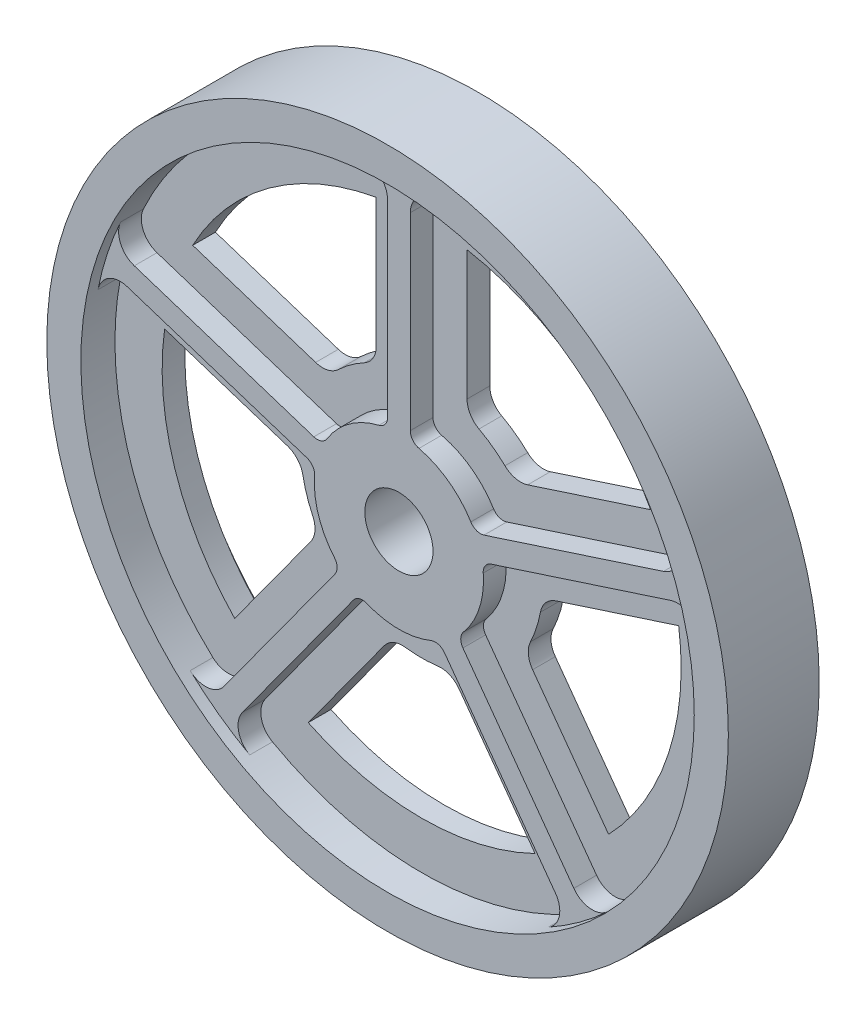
from build123d import *

# Parameters (mm, degrees)
CROQUIS1_R               = 150
CROQUIS1_R_2             = 135
EXTRUIR1_DEPTH           = 20
CROQUIS4_R               = 138.391148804
CROQUIS4_R_2             = 114.224298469
EXTRUIR4_DEPTH           = 5
EXTRUIR5_DEPTH           = 5
EXTRUIR6_DEPTH           = 10
REDONDEO2_R              = 10
REDONDEO3_R              = 10
REDONDEO4_R              = 10
REDONDEO2_OF_SIMETR_A1_R = 10
REDONDEO3_OF_SIMETR_A1_R = 10
REDONDEO4_OF_SIMETR_A1_R = 10
CROQUIS6_R               = 15
EXTRUIR7_DEPTH           = 216


with BuildPart() as part:
    # Croquis1 → Extruir1 (new, symmetric)
    with BuildSketch(Plane.XY):
        Circle(CROQUIS1_R)
        Circle(CROQUIS1_R_2, mode=Mode.SUBTRACT)
    extrude(amount=EXTRUIR1_DEPTH, both=True)

    # Croquis4 → Extruir4 (add, symmetric)
    with BuildSketch(Plane.XY):
        Circle(CROQUIS4_R)
        Circle(CROQUIS4_R_2, mode=Mode.SUBTRACT)
    extrude(amount=EXTRUIR4_DEPTH, both=True)

    # Croquis2 → Extruir5 (add, symmetric)
    with BuildSketch(Plane.XY):
        with BuildLine():
            Line((59.027905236, -1.849915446), (136.416444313, 23.295145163))
            ThreePointArc((136.416444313, 23.295145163), (131.617803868, 42.765216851), (124.055764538, 61.337405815))
            Line((124.055764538, 61.337405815), (46.667225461, 36.192345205))
            ThreePointArc((46.667225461, 36.192345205), (41.358508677, 35.952112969), (36.676313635, 38.465523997))
            ThreePointArc((36.676313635, 38.465523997), (31.239824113, 42.997929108), (25.249283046, 46.767747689))
            ThreePointArc((25.249283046, 46.767747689), (21.412009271, 50.444093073), (20, 55.567218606))
            Line((20, 55.567218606), (20, 136.938344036))
            ThreePointArc((20, 136.938344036), (0, 138.391148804), (-20, 136.938344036))
            Line((-20, 136.938344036), (-20, 55.567218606))
            ThreePointArc((-20, 55.567218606), (-21.412009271, 50.444093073), (-25.249283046, 46.767747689))
            ThreePointArc((-25.249283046, 46.767747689), (-31.239824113, 42.997929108), (-36.676313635, 38.465523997))
            ThreePointArc((-36.676313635, 38.465523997), (-41.358508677, 35.952112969), (-46.667225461, 36.192345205))
            Line((-46.667225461, 36.192345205), (-124.055764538, 61.337405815))
            ThreePointArc((-124.055764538, 61.337405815), (-131.617803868, 42.765216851), (-136.416444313, 23.295145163))
            Line((-136.416444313, 23.295145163), (-59.027905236, -1.849915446))
            ThreePointArc((-59.027905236, -1.849915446), (-54.591858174, -4.775948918), (-52.281228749, -9.561466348))
            ThreePointArc((-52.281228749, -9.561466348), (-50.547097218, -16.423747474), (-47.916491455, -22.994746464))
            ThreePointArc((-47.916491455, -22.994746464), (-46.972973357, -28.224465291), (-48.841931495, -33.199119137))
            Line((-48.841931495, -33.199119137), (-96.670678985, -99.029742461))
            ThreePointArc((-96.670678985, -99.029742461), (-81.344276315, -111.960791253), (-64.30999921, -122.541152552))
            Line((-64.30999921, -122.541152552), (-16.48125172, -56.710529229))
            ThreePointArc((-16.48125172, -56.710529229), (-12.32761459, -53.395791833), (-7.062293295, -52.677058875))
            ThreePointArc((-7.062293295, -52.677058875), (0, -53.14836327), (7.062293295, -52.677058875))
            ThreePointArc((7.062293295, -52.677058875), (12.32761459, -53.395791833), (16.48125172, -56.710529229))
            Line((16.48125172, -56.710529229), (64.30999921, -122.541152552))
            ThreePointArc((64.30999921, -122.541152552), (81.344276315, -111.960791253), (96.670678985, -99.029742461))
            Line((96.670678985, -99.029742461), (48.841931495, -33.199119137))
            ThreePointArc((48.841931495, -33.199119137), (46.972973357, -28.224465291), (47.916491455, -22.994746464))
            ThreePointArc((47.916491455, -22.994746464), (50.547097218, -16.423747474), (52.281228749, -9.561466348))
            ThreePointArc((52.281228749, -9.561466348), (54.591858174, -4.775948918), (59.027905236, -1.849915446))
        make_face()
    extrude(amount=EXTRUIR5_DEPTH, both=True)

    # Croquis5 → Extruir6 (add)
    with BuildSketch(Plane.XY.offset(5)):
        with BuildLine():
            Line((126.75945372, 46.443954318), (37.466944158, 17.431059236))
            ThreePointArc((37.466944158, 17.431059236), (34.199489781, 17.492362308), (31.667832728, 19.558936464))
            ThreePointArc((31.667832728, 19.558936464), (21.877961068, 30.112430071), (8.815755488, 36.161942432))
            ThreePointArc((8.815755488, 36.161942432), (6.068001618, 37.931084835), (5, 41.019674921))
            Line((5, 41.019674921), (5, 134.907375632))
            ThreePointArc((5, 134.907375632), (0, 135), (-5, 134.907375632))
            Line((-5, 134.907375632), (-5, 41.019674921))
            ThreePointArc((-5, 41.019674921), (-6.068001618, 37.931084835), (-8.815755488, 36.161942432))
            ThreePointArc((-8.815755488, 36.161942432), (-21.877961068, 30.112430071), (-31.667832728, 19.558936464))
            ThreePointArc((-31.667832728, 19.558936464), (-34.199489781, 17.492362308), (-37.466944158, 17.431059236))
            Line((-37.466944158, 17.431059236), (-126.75945372, 46.443954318))
            ThreePointArc((-126.75945372, 46.443954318), (-128.3926297, 41.717294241), (-129.849623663, 36.933389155))
            Line((-129.849623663, 36.933389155), (-40.557114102, 7.920494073))
            ThreePointArc((-40.557114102, 7.920494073), (-37.949721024, 5.95033735), (-37.116269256, 2.790373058))
            ThreePointArc((-37.116269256, 2.790373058), (-35.399284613, -11.501924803), (-28.387552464, -24.073854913))
            ThreePointArc((-28.387552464, -24.073854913), (-27.2044487, -27.120210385), (-28.155844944, -30.246687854))
            Line((-28.155844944, -30.246687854), (-83.341650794, -106.203433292))
            ThreePointArc((-83.341650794, -106.203433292), (-79.351009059, -109.217294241), (-75.25148085, -112.081285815))
            Line((-75.25148085, -112.081285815), (-20.065675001, -36.124540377))
            ThreePointArc((-20.065675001, -36.124540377), (-17.386215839, -34.253574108), (-14.123360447, -34.437397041))
            ThreePointArc((-14.123360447, -34.437397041), (0, -37.221010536), (14.123360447, -34.437397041))
            ThreePointArc((14.123360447, -34.437397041), (17.386215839, -34.253574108), (20.065675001, -36.124540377))
            Line((20.065675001, -36.124540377), (75.25148085, -112.081285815))
            ThreePointArc((75.25148085, -112.081285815), (79.351009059, -109.217294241), (83.341650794, -106.203433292))
            Line((83.341650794, -106.203433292), (28.155844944, -30.246687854))
            ThreePointArc((28.155844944, -30.246687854), (27.2044487, -27.120210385), (28.387552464, -24.073854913))
            ThreePointArc((28.387552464, -24.073854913), (35.399284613, -11.501924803), (37.116269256, 2.790373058))
            ThreePointArc((37.116269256, 2.790373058), (37.949721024, 5.95033735), (40.557114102, 7.920494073))
            Line((40.557114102, 7.920494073), (129.849623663, 36.933389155))
            ThreePointArc((129.849623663, 36.933389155), (128.3926297, 41.717294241), (126.75945372, 46.443954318))
        make_face()
    extruir6 = extrude(amount=EXTRUIR6_DEPTH)

    # Redondeo2
    redondeo2_edges = [part.edges().sort_by_distance(p)[0] for p in [
        (-126.75945372, 46.443954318, 10),
    ]]
    fillet(redondeo2_edges, radius=REDONDEO2_R)

    # Redondeo3
    redondeo3_edges = [part.edges().sort_by_distance(p)[0] for p in [
        (-129.849623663, 36.933389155, 10),
    ]]
    fillet(redondeo3_edges, radius=REDONDEO3_R)

    # Redondeo4
    redondeo4_edges = [part.edges().sort_by_distance(p)[0] for p in [
        (-83.341650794, -106.203433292, 10),
        (-75.25148085, -112.081285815, 10),
        (75.25148085, -112.081285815, 10),
        (83.341650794, -106.203433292, 10),
        (129.849623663, 36.933389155, 10),
        (126.75945372, 46.443954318, 10),
        (5, 134.907375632, 10),
        (-5, 134.907375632, 10),
    ]]
    fillet(redondeo4_edges, radius=REDONDEO4_R)

    # Simetr_a1: Extruir6 across plane
    add(extruir6.mirror(Plane.XY))

    # Redondeo2 of Simetr_a1
    redondeo2_of_simetr_a1_edges = [part.edges().sort_by_distance(p)[0] for p in [
        (-126.75945372, 46.443954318, -10),
    ]]
    fillet(redondeo2_of_simetr_a1_edges, radius=REDONDEO2_OF_SIMETR_A1_R)

    # Redondeo3 of Simetr_a1
    redondeo3_of_simetr_a1_edges = [part.edges().sort_by_distance(p)[0] for p in [
        (-129.849623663, 36.933389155, -10),
    ]]
    fillet(redondeo3_of_simetr_a1_edges, radius=REDONDEO3_OF_SIMETR_A1_R)

    # Redondeo4 of Simetr_a1
    redondeo4_of_simetr_a1_edges = [part.edges().sort_by_distance(p)[0] for p in [
        (-83.341650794, -106.203433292, -10),
        (-75.25148085, -112.081285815, -10),
        (75.25148085, -112.081285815, -10),
        (83.341650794, -106.203433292, -10),
        (129.849623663, 36.933389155, -10),
        (126.75945372, 46.443954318, -10),
        (5, 134.907375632, -10),
        (-5, 134.907375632, -10),
    ]]
    fillet(redondeo4_of_simetr_a1_edges, radius=REDONDEO4_OF_SIMETR_A1_R)

    # Croquis6 → Extruir7 (cut, through all)
    with BuildSketch(Plane(origin=(0, 0, -15), x_dir=(-1, 0, 0), z_dir=(0, 0, -1))):
        Circle(CROQUIS6_R)
    extrude(amount=-EXTRUIR7_DEPTH, mode=Mode.SUBTRACT)


solid = part.part
